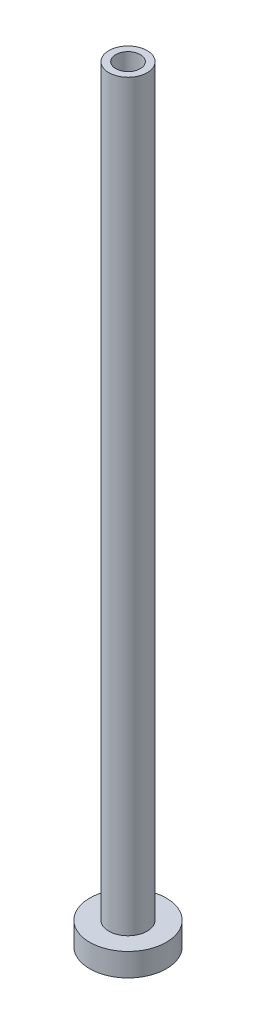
ISO-10303-21;
HEADER;
FILE_DESCRIPTION(('STEP AP214'),'2;1');
FILE_NAME('part.step','',(''),(''),'','','');
FILE_SCHEMA(('AUTOMOTIVE_DESIGN { 1 0 10303 214 1 1 1 1 }'));
ENDSEC;
DATA;
#1=APPLICATION_CONTEXT('core data for automotive mechanical design processes');
#2=APPLICATION_PROTOCOL_DEFINITION('international standard','automotive_design',2000,#1);
#3=PRODUCT_CONTEXT('',#1,'mechanical');
#4=PRODUCT('Part','Part','',(#3));
#5=PRODUCT_RELATED_PRODUCT_CATEGORY('part','',(#4));
#6=PRODUCT_DEFINITION_FORMATION('','',#4);
#7=PRODUCT_DEFINITION_CONTEXT('part definition',#1,'design');
#8=PRODUCT_DEFINITION('design','',#6,#7);
#9=PRODUCT_DEFINITION_SHAPE('','',#8);
#10=(LENGTH_UNIT() NAMED_UNIT(*) SI_UNIT(.MILLI.,.METRE.));
#11=(NAMED_UNIT(*) PLANE_ANGLE_UNIT() SI_UNIT($,.RADIAN.));
#12=(NAMED_UNIT(*) SI_UNIT($,.STERADIAN.) SOLID_ANGLE_UNIT());
#13=UNCERTAINTY_MEASURE_WITH_UNIT(LENGTH_MEASURE(1.E-05),#10,'distance_accuracy_value','');
#14=(GEOMETRIC_REPRESENTATION_CONTEXT(3) GLOBAL_UNCERTAINTY_ASSIGNED_CONTEXT((#13)) GLOBAL_UNIT_ASSIGNED_CONTEXT((#10,
#11,#12)) REPRESENTATION_CONTEXT('',''));
#15=CARTESIAN_POINT('',(0.,0.,0.));
#16=DIRECTION('',(0.,0.,1.));
#17=DIRECTION('',(1.,0.,0.));
#18=AXIS2_PLACEMENT_3D('',#15,#16,#17);
#19=CARTESIAN_POINT('',(0.,0.,0.));
#20=DIRECTION('',(0.,-1.,0.));
#21=DIRECTION('',(0.,0.,-1.));
#22=AXIS2_PLACEMENT_3D('',#19,#20,#21);
#23=CYLINDRICAL_SURFACE('',#22,5.);
#24=CARTESIAN_POINT('',(0.,-3.,0.));
#25=DIRECTION('',(0.,-1.,0.));
#26=DIRECTION('',(0.,0.,-1.));
#27=AXIS2_PLACEMENT_3D('',#24,#25,#26);
#28=CIRCLE('',#27,5.);
#29=CARTESIAN_POINT('',(0.,-3.,-5.));
#30=VERTEX_POINT('',#29);
#31=EDGE_CURVE('E42',#30,#30,#28,.T.);
#32=ORIENTED_EDGE('',*,*,#31,.F.);
#33=EDGE_LOOP('',(#32));
#34=FACE_BOUND('',#33,.T.);
#35=CARTESIAN_POINT('',(0.,0.,0.));
#36=DIRECTION('',(0.,-1.,0.));
#37=DIRECTION('',(0.,0.,-1.));
#38=AXIS2_PLACEMENT_3D('',#35,#36,#37);
#39=CIRCLE('',#38,5.);
#40=CARTESIAN_POINT('',(0.,0.,-5.));
#41=VERTEX_POINT('',#40);
#42=EDGE_CURVE('E9',#41,#41,#39,.T.);
#43=ORIENTED_EDGE('',*,*,#42,.T.);
#44=EDGE_LOOP('',(#43));
#45=FACE_BOUND('',#44,.T.);
#46=ADVANCED_FACE('F14',(#34,#45),#23,.T.);
#47=CARTESIAN_POINT('',(-5.,0.,0.));
#48=DIRECTION('',(0.,-1.,0.));
#49=DIRECTION('',(0.,0.,-1.));
#50=AXIS2_PLACEMENT_3D('',#47,#48,#49);
#51=PLANE('',#50);
#52=ORIENTED_EDGE('',*,*,#42,.F.);
#53=EDGE_LOOP('',(#52));
#54=FACE_BOUND('',#53,.T.);
#55=CARTESIAN_POINT('',(0.,0.,0.));
#56=DIRECTION('',(0.,-1.,0.));
#57=DIRECTION('',(0.,0.,-1.));
#58=AXIS2_PLACEMENT_3D('',#55,#56,#57);
#59=CIRCLE('',#58,2.5);
#60=CARTESIAN_POINT('',(0.,0.,-2.5));
#61=VERTEX_POINT('',#60);
#62=EDGE_CURVE('E20',#61,#61,#59,.T.);
#63=ORIENTED_EDGE('',*,*,#62,.T.);
#64=EDGE_LOOP('',(#63));
#65=FACE_BOUND('',#64,.T.);
#66=ADVANCED_FACE('F49',(#54,#65),#51,.F.);
#67=CARTESIAN_POINT('',(0.,0.,0.));
#68=DIRECTION('',(0.,-1.,0.));
#69=DIRECTION('',(0.,0.,-1.));
#70=AXIS2_PLACEMENT_3D('',#67,#68,#69);
#71=CYLINDRICAL_SURFACE('',#70,2.5);
#72=ORIENTED_EDGE('',*,*,#62,.F.);
#73=EDGE_LOOP('',(#72));
#74=FACE_BOUND('',#73,.T.);
#75=CARTESIAN_POINT('',(0.,97.,0.));
#76=DIRECTION('',(0.,-1.,0.));
#77=DIRECTION('',(0.,0.,-1.));
#78=AXIS2_PLACEMENT_3D('',#75,#76,#77);
#79=CIRCLE('',#78,2.5);
#80=CARTESIAN_POINT('',(0.,97.,-2.5));
#81=VERTEX_POINT('',#80);
#82=EDGE_CURVE('E24',#81,#81,#79,.T.);
#83=ORIENTED_EDGE('',*,*,#82,.T.);
#84=EDGE_LOOP('',(#83));
#85=FACE_BOUND('',#84,.T.);
#86=ADVANCED_FACE('F55',(#74,#85),#71,.T.);
#87=CARTESIAN_POINT('',(-2.5,97.,0.));
#88=DIRECTION('',(0.,-1.,0.));
#89=DIRECTION('',(0.,0.,-1.));
#90=AXIS2_PLACEMENT_3D('',#87,#88,#89);
#91=PLANE('',#90);
#92=ORIENTED_EDGE('',*,*,#82,.F.);
#93=EDGE_LOOP('',(#92));
#94=FACE_BOUND('',#93,.T.);
#95=CARTESIAN_POINT('',(0.,97.,0.));
#96=DIRECTION('',(0.,-1.,0.));
#97=DIRECTION('',(0.,0.,-1.));
#98=AXIS2_PLACEMENT_3D('',#95,#96,#97);
#99=CIRCLE('',#98,1.6);
#100=CARTESIAN_POINT('',(0.,97.,-1.6));
#101=VERTEX_POINT('',#100);
#102=EDGE_CURVE('E28',#101,#101,#99,.T.);
#103=ORIENTED_EDGE('',*,*,#102,.T.);
#104=EDGE_LOOP('',(#103));
#105=FACE_BOUND('',#104,.T.);
#106=ADVANCED_FACE('F61',(#94,#105),#91,.F.);
#107=CARTESIAN_POINT('',(0.,0.,0.));
#108=DIRECTION('',(0.,-1.,0.));
#109=DIRECTION('',(0.,0.,-1.));
#110=AXIS2_PLACEMENT_3D('',#107,#108,#109);
#111=CYLINDRICAL_SURFACE('',#110,1.6);
#112=ORIENTED_EDGE('',*,*,#102,.F.);
#113=EDGE_LOOP('',(#112));
#114=FACE_BOUND('',#113,.T.);
#115=CARTESIAN_POINT('',(0.,52.,0.));
#116=DIRECTION('',(0.,-1.,0.));
#117=DIRECTION('',(0.,0.,-1.));
#118=AXIS2_PLACEMENT_3D('',#115,#116,#117);
#119=CIRCLE('',#118,1.6);
#120=CARTESIAN_POINT('',(0.,52.,-1.6));
#121=VERTEX_POINT('',#120);
#122=EDGE_CURVE('E33',#121,#121,#119,.T.);
#123=ORIENTED_EDGE('',*,*,#122,.T.);
#124=EDGE_LOOP('',(#123));
#125=FACE_BOUND('',#124,.T.);
#126=ADVANCED_FACE('F67',(#114,#125),#111,.F.);
#127=CARTESIAN_POINT('',(0.,51.85,0.));
#128=DIRECTION('',(0.,-1.,0.));
#129=DIRECTION('',(0.,0.,-1.));
#130=AXIS2_PLACEMENT_3D('',#127,#128,#129);
#131=CONICAL_SURFACE('',#130,1.75,0.78539816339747);
#132=ORIENTED_EDGE('',*,*,#122,.F.);
#133=EDGE_LOOP('',(#132));
#134=FACE_BOUND('',#133,.T.);
#135=CARTESIAN_POINT('',(0.,51.85,0.));
#136=DIRECTION('',(0.,-1.,0.));
#137=DIRECTION('',(0.,0.,-1.));
#138=AXIS2_PLACEMENT_3D('',#135,#136,#137);
#139=CIRCLE('',#138,1.75);
#140=CARTESIAN_POINT('',(0.,51.85,-1.75));
#141=VERTEX_POINT('',#140);
#142=EDGE_CURVE('E36',#141,#141,#139,.T.);
#143=ORIENTED_EDGE('',*,*,#142,.T.);
#144=EDGE_LOOP('',(#143));
#145=FACE_BOUND('',#144,.T.);
#146=ADVANCED_FACE('F71',(#134,#145),#131,.F.);
#147=CARTESIAN_POINT('',(0.,0.,0.));
#148=DIRECTION('',(0.,-1.,0.));
#149=DIRECTION('',(0.,0.,-1.));
#150=AXIS2_PLACEMENT_3D('',#147,#148,#149);
#151=CYLINDRICAL_SURFACE('',#150,1.75);
#152=ORIENTED_EDGE('',*,*,#142,.F.);
#153=EDGE_LOOP('',(#152));
#154=FACE_BOUND('',#153,.T.);
#155=CARTESIAN_POINT('',(0.,-3.,0.));
#156=DIRECTION('',(0.,-1.,0.));
#157=DIRECTION('',(0.,0.,-1.));
#158=AXIS2_PLACEMENT_3D('',#155,#156,#157);
#159=CIRCLE('',#158,1.75);
#160=CARTESIAN_POINT('',(0.,-3.,-1.75));
#161=VERTEX_POINT('',#160);
#162=EDGE_CURVE('E39',#161,#161,#159,.T.);
#163=ORIENTED_EDGE('',*,*,#162,.T.);
#164=EDGE_LOOP('',(#163));
#165=FACE_BOUND('',#164,.T.);
#166=ADVANCED_FACE('F75',(#154,#165),#151,.F.);
#167=CARTESIAN_POINT('',(-1.75,-3.,0.));
#168=DIRECTION('',(0.,1.,0.));
#169=DIRECTION('',(0.,0.,1.));
#170=AXIS2_PLACEMENT_3D('',#167,#168,#169);
#171=PLANE('',#170);
#172=ORIENTED_EDGE('',*,*,#162,.F.);
#173=EDGE_LOOP('',(#172));
#174=FACE_BOUND('',#173,.T.);
#175=ORIENTED_EDGE('',*,*,#31,.T.);
#176=EDGE_LOOP('',(#175));
#177=FACE_BOUND('',#176,.T.);
#178=ADVANCED_FACE('F46',(#174,#177),#171,.F.);
#179=CLOSED_SHELL('',(#46,#66,#86,#106,#126,#146,#166,#178));
#180=MANIFOLD_SOLID_BREP('B1',#179);
#181=ADVANCED_BREP_SHAPE_REPRESENTATION('',(#18,#180),#14);
#182=SHAPE_DEFINITION_REPRESENTATION(#9,#181);
ENDSEC;
END-ISO-10303-21;
